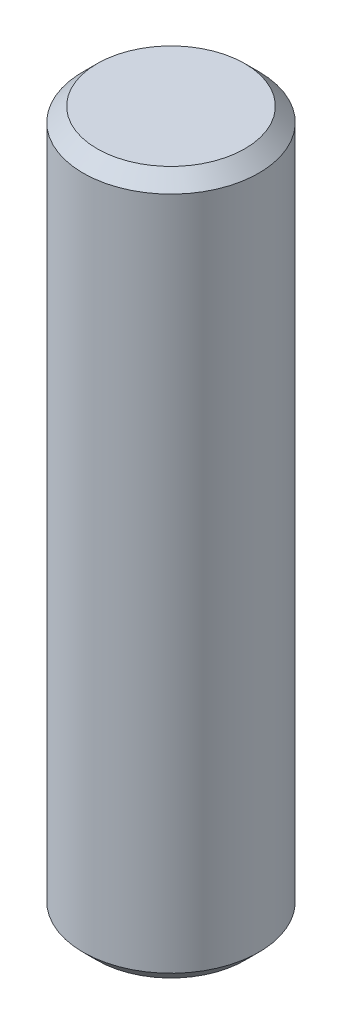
from build123d import *

# Parameters (mm, degrees)
SKETCH1_R      = 9.52754
EXTRUDE1_DEPTH = 38.1
CHAMFER1_SIZE  = 1.524


with BuildPart() as part:
    # Sketch1 → Extrude1 (new, symmetric)
    with BuildSketch(Plane(origin=(0, 0, 0), x_dir=(1, 0, 0), z_dir=(0, 1, 0))):
        with Locations(Location((0, 0, 0), (0, 0, 90))):
            Circle(SKETCH1_R)
    extrude(amount=EXTRUDE1_DEPTH, both=True)

    # Chamfer1
    chamfer1_edges = [part.edges().sort_by_distance(p)[0] for p in [
        (0, -38.1, 9.52754),
        (0, 38.1, 9.52754),
    ]]
    chamfer(chamfer1_edges, length=CHAMFER1_SIZE)


solid = part.part
